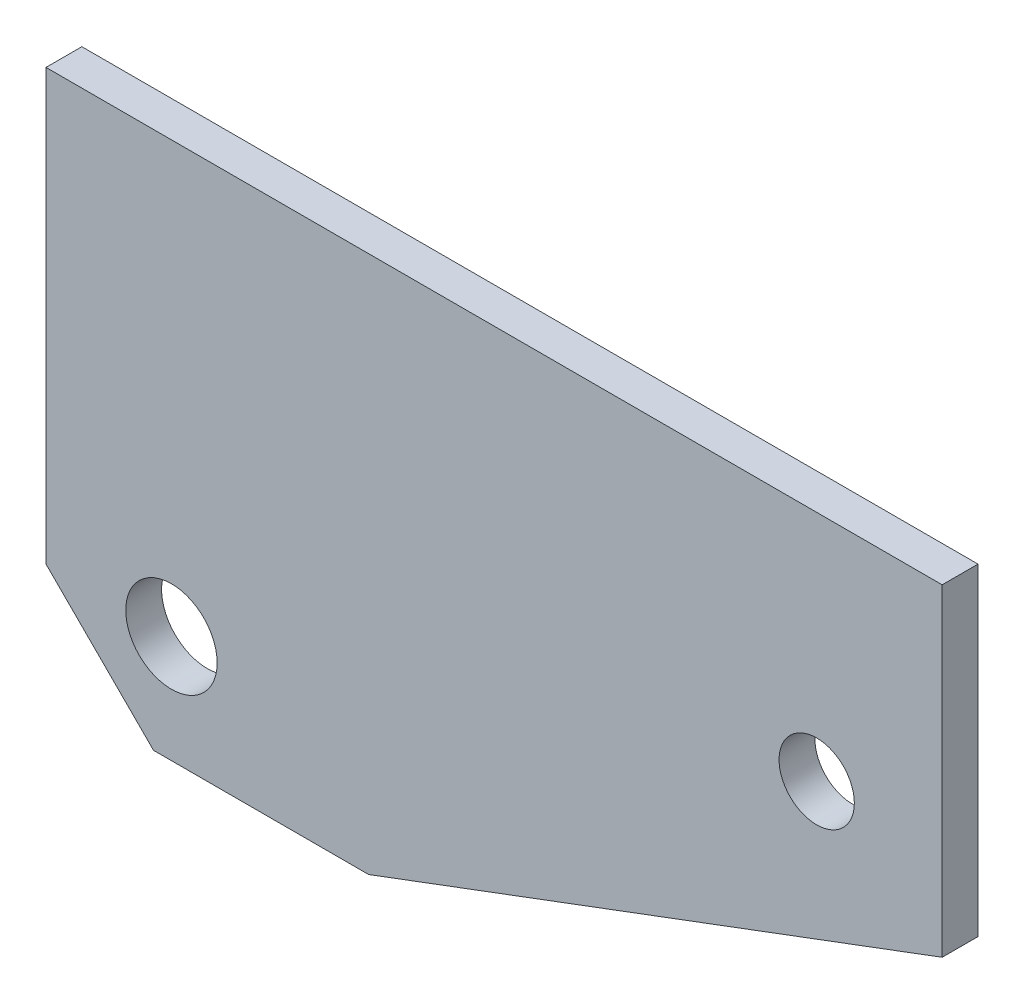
ISO-10303-21;
HEADER;
FILE_DESCRIPTION(('STEP AP214'),'2;1');
FILE_NAME('part.step','',(''),(''),'','','');
FILE_SCHEMA(('AUTOMOTIVE_DESIGN { 1 0 10303 214 1 1 1 1 }'));
ENDSEC;
DATA;
#1=APPLICATION_CONTEXT('core data for automotive mechanical design processes');
#2=APPLICATION_PROTOCOL_DEFINITION('international standard','automotive_design',2000,#1);
#3=PRODUCT_CONTEXT('',#1,'mechanical');
#4=PRODUCT('Part','Part','',(#3));
#5=PRODUCT_RELATED_PRODUCT_CATEGORY('part','',(#4));
#6=PRODUCT_DEFINITION_FORMATION('','',#4);
#7=PRODUCT_DEFINITION_CONTEXT('part definition',#1,'design');
#8=PRODUCT_DEFINITION('design','',#6,#7);
#9=PRODUCT_DEFINITION_SHAPE('','',#8);
#10=(LENGTH_UNIT() NAMED_UNIT(*) SI_UNIT(.MILLI.,.METRE.));
#11=(NAMED_UNIT(*) PLANE_ANGLE_UNIT() SI_UNIT($,.RADIAN.));
#12=(NAMED_UNIT(*) SI_UNIT($,.STERADIAN.) SOLID_ANGLE_UNIT());
#13=UNCERTAINTY_MEASURE_WITH_UNIT(LENGTH_MEASURE(1.E-05),#10,'distance_accuracy_value','');
#14=(GEOMETRIC_REPRESENTATION_CONTEXT(3) GLOBAL_UNCERTAINTY_ASSIGNED_CONTEXT((#13)) GLOBAL_UNIT_ASSIGNED_CONTEXT((#10,
#11,#12)) REPRESENTATION_CONTEXT('',''));
#15=CARTESIAN_POINT('',(0.,0.,0.));
#16=DIRECTION('',(0.,0.,1.));
#17=DIRECTION('',(1.,0.,0.));
#18=AXIS2_PLACEMENT_3D('',#15,#16,#17);
#19=CARTESIAN_POINT('',(0.,-150.,10.));
#20=DIRECTION('',(0.,0.,1.));
#21=DIRECTION('',(1.,0.,0.));
#22=AXIS2_PLACEMENT_3D('',#19,#20,#21);
#23=PLANE('',#22);
#24=CARTESIAN_POINT('',(215.,-65.,10.));
#25=DIRECTION('',(0.,0.,1.));
#26=DIRECTION('',(1.,0.,0.));
#27=AXIS2_PLACEMENT_3D('',#24,#25,#26);
#28=CIRCLE('',#27,10.5);
#29=CARTESIAN_POINT('',(225.5,-65.,10.));
#30=VERTEX_POINT('',#29);
#31=EDGE_CURVE('E101',#30,#30,#28,.T.);
#32=ORIENTED_EDGE('',*,*,#31,.F.);
#33=EDGE_LOOP('',(#32));
#34=FACE_BOUND('',#33,.T.);
#35=DIRECTION('',(0.,-1.,0.));
#36=VECTOR('',#35,1.);
#37=CARTESIAN_POINT('',(0.,0.,10.));
#38=LINE('',#37,#36);
#39=CARTESIAN_POINT('',(0.,0.,10.));
#40=VERTEX_POINT('',#39);
#41=CARTESIAN_POINT('',(0.,-120.,10.));
#42=VERTEX_POINT('',#41);
#43=EDGE_CURVE('E115',#40,#42,#38,.T.);
#44=ORIENTED_EDGE('',*,*,#43,.T.);
#45=DIRECTION('',(0.707106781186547,-0.707106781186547,0.));
#46=VECTOR('',#45,1.);
#47=CARTESIAN_POINT('',(0.,-120.,10.));
#48=LINE('',#47,#46);
#49=CARTESIAN_POINT('',(30.,-150.,10.));
#50=VERTEX_POINT('',#49);
#51=EDGE_CURVE('E96',#42,#50,#48,.T.);
#52=ORIENTED_EDGE('',*,*,#51,.T.);
#53=DIRECTION('',(1.,0.,0.));
#54=VECTOR('',#53,1.);
#55=CARTESIAN_POINT('',(30.,-150.,10.));
#56=LINE('',#55,#54);
#57=CARTESIAN_POINT('',(90.,-150.,10.));
#58=VERTEX_POINT('',#57);
#59=EDGE_CURVE('E118',#50,#58,#56,.T.);
#60=ORIENTED_EDGE('',*,*,#59,.T.);
#61=DIRECTION('',(0.936329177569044,0.351123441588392,0.));
#62=VECTOR('',#61,1.);
#63=CARTESIAN_POINT('',(90.,-150.,10.));
#64=LINE('',#63,#62);
#65=CARTESIAN_POINT('',(250.,-90.,10.));
#66=VERTEX_POINT('',#65);
#67=EDGE_CURVE('E120',#58,#66,#64,.T.);
#68=ORIENTED_EDGE('',*,*,#67,.T.);
#69=DIRECTION('',(0.,1.,0.));
#70=VECTOR('',#69,1.);
#71=CARTESIAN_POINT('',(250.,0.,10.));
#72=LINE('',#71,#70);
#73=CARTESIAN_POINT('',(250.,0.,10.));
#74=VERTEX_POINT('',#73);
#75=EDGE_CURVE('E49',#66,#74,#72,.T.);
#76=ORIENTED_EDGE('',*,*,#75,.T.);
#77=DIRECTION('',(-1.,0.,0.));
#78=VECTOR('',#77,1.);
#79=CARTESIAN_POINT('',(0.,0.,10.));
#80=LINE('',#79,#78);
#81=EDGE_CURVE('E44',#74,#40,#80,.T.);
#82=ORIENTED_EDGE('',*,*,#81,.T.);
#83=EDGE_LOOP('',(#44,#52,#60,#68,#76,#82));
#84=FACE_BOUND('',#83,.T.);
#85=CARTESIAN_POINT('',(35.,-120.,10.));
#86=DIRECTION('',(0.,0.,1.));
#87=DIRECTION('',(1.,0.,0.));
#88=AXIS2_PLACEMENT_3D('',#85,#86,#87);
#89=CIRCLE('',#88,12.75);
#90=CARTESIAN_POINT('',(47.75,-120.,10.));
#91=VERTEX_POINT('',#90);
#92=EDGE_CURVE('E175',#91,#91,#89,.T.);
#93=ORIENTED_EDGE('',*,*,#92,.F.);
#94=EDGE_LOOP('',(#93));
#95=FACE_BOUND('',#94,.T.);
#96=ADVANCED_FACE('F29',(#34,#84,#95),#23,.T.);
#97=CARTESIAN_POINT('',(0.,-150.,0.));
#98=DIRECTION('',(0.,0.,1.));
#99=DIRECTION('',(1.,0.,0.));
#100=AXIS2_PLACEMENT_3D('',#97,#98,#99);
#101=PLANE('',#100);
#102=CARTESIAN_POINT('',(215.,-65.,0.));
#103=DIRECTION('',(0.,0.,1.));
#104=DIRECTION('',(1.,0.,0.));
#105=AXIS2_PLACEMENT_3D('',#102,#103,#104);
#106=CIRCLE('',#105,10.5);
#107=CARTESIAN_POINT('',(225.5,-65.,0.));
#108=VERTEX_POINT('',#107);
#109=EDGE_CURVE('E104',#108,#108,#106,.T.);
#110=ORIENTED_EDGE('',*,*,#109,.T.);
#111=EDGE_LOOP('',(#110));
#112=FACE_BOUND('',#111,.T.);
#113=DIRECTION('',(0.,-1.,0.));
#114=VECTOR('',#113,1.);
#115=CARTESIAN_POINT('',(0.,0.,0.));
#116=LINE('',#115,#114);
#117=CARTESIAN_POINT('',(0.,0.,0.));
#118=VERTEX_POINT('',#117);
#119=CARTESIAN_POINT('',(0.,-120.,0.));
#120=VERTEX_POINT('',#119);
#121=EDGE_CURVE('E87',#118,#120,#116,.T.);
#122=ORIENTED_EDGE('',*,*,#121,.F.);
#123=DIRECTION('',(-1.,0.,0.));
#124=VECTOR('',#123,1.);
#125=CARTESIAN_POINT('',(0.,0.,0.));
#126=LINE('',#125,#124);
#127=CARTESIAN_POINT('',(250.,0.,0.));
#128=VERTEX_POINT('',#127);
#129=EDGE_CURVE('E113',#128,#118,#126,.T.);
#130=ORIENTED_EDGE('',*,*,#129,.F.);
#131=DIRECTION('',(0.,1.,0.));
#132=VECTOR('',#131,1.);
#133=CARTESIAN_POINT('',(250.,0.,0.));
#134=LINE('',#133,#132);
#135=CARTESIAN_POINT('',(250.,-90.,0.));
#136=VERTEX_POINT('',#135);
#137=EDGE_CURVE('E111',#136,#128,#134,.T.);
#138=ORIENTED_EDGE('',*,*,#137,.F.);
#139=DIRECTION('',(0.936329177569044,0.351123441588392,0.));
#140=VECTOR('',#139,1.);
#141=CARTESIAN_POINT('',(90.,-150.,0.));
#142=LINE('',#141,#140);
#143=CARTESIAN_POINT('',(90.,-150.,0.));
#144=VERTEX_POINT('',#143);
#145=EDGE_CURVE('E109',#144,#136,#142,.T.);
#146=ORIENTED_EDGE('',*,*,#145,.F.);
#147=DIRECTION('',(1.,0.,0.));
#148=VECTOR('',#147,1.);
#149=CARTESIAN_POINT('',(30.,-150.,0.));
#150=LINE('',#149,#148);
#151=CARTESIAN_POINT('',(30.,-150.,0.));
#152=VERTEX_POINT('',#151);
#153=EDGE_CURVE('E89',#152,#144,#150,.T.);
#154=ORIENTED_EDGE('',*,*,#153,.F.);
#155=DIRECTION('',(0.707106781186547,-0.707106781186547,0.));
#156=VECTOR('',#155,1.);
#157=CARTESIAN_POINT('',(0.,-120.,0.));
#158=LINE('',#157,#156);
#159=EDGE_CURVE('E82',#120,#152,#158,.T.);
#160=ORIENTED_EDGE('',*,*,#159,.F.);
#161=EDGE_LOOP('',(#122,#130,#138,#146,#154,#160));
#162=FACE_BOUND('',#161,.T.);
#163=CARTESIAN_POINT('',(35.,-120.,0.));
#164=DIRECTION('',(0.,0.,1.));
#165=DIRECTION('',(1.,0.,0.));
#166=AXIS2_PLACEMENT_3D('',#163,#164,#165);
#167=CIRCLE('',#166,12.75);
#168=CARTESIAN_POINT('',(47.75,-120.,0.));
#169=VERTEX_POINT('',#168);
#170=EDGE_CURVE('E178',#169,#169,#167,.T.);
#171=ORIENTED_EDGE('',*,*,#170,.T.);
#172=EDGE_LOOP('',(#171));
#173=FACE_BOUND('',#172,.T.);
#174=ADVANCED_FACE('F83',(#112,#162,#173),#101,.F.);
#175=CARTESIAN_POINT('',(0.,0.,10.));
#176=DIRECTION('',(1.,0.,0.));
#177=DIRECTION('',(0.,1.,0.));
#178=AXIS2_PLACEMENT_3D('',#175,#176,#177);
#179=PLANE('',#178);
#180=ORIENTED_EDGE('',*,*,#121,.T.);
#181=DIRECTION('',(0.,0.,-1.));
#182=VECTOR('',#181,1.);
#183=CARTESIAN_POINT('',(0.,-120.,10.));
#184=LINE('',#183,#182);
#185=EDGE_CURVE('E11',#42,#120,#184,.T.);
#186=ORIENTED_EDGE('',*,*,#185,.F.);
#187=ORIENTED_EDGE('',*,*,#43,.F.);
#188=DIRECTION('',(0.,0.,-1.));
#189=VECTOR('',#188,1.);
#190=CARTESIAN_POINT('',(0.,0.,10.));
#191=LINE('',#190,#189);
#192=EDGE_CURVE('E100',#40,#118,#191,.T.);
#193=ORIENTED_EDGE('',*,*,#192,.T.);
#194=EDGE_LOOP('',(#180,#186,#187,#193));
#195=FACE_BOUND('',#194,.T.);
#196=ADVANCED_FACE('F31',(#195),#179,.F.);
#197=CARTESIAN_POINT('',(0.,-120.,10.));
#198=DIRECTION('',(0.707106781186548,0.707106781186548,0.));
#199=DIRECTION('',(-0.707106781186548,0.707106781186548,0.));
#200=AXIS2_PLACEMENT_3D('',#197,#198,#199);
#201=PLANE('',#200);
#202=ORIENTED_EDGE('',*,*,#159,.T.);
#203=DIRECTION('',(0.,0.,-1.));
#204=VECTOR('',#203,1.);
#205=CARTESIAN_POINT('',(30.,-150.,10.));
#206=LINE('',#205,#204);
#207=EDGE_CURVE('E37',#50,#152,#206,.T.);
#208=ORIENTED_EDGE('',*,*,#207,.F.);
#209=ORIENTED_EDGE('',*,*,#51,.F.);
#210=ORIENTED_EDGE('',*,*,#185,.T.);
#211=EDGE_LOOP('',(#202,#208,#209,#210));
#212=FACE_BOUND('',#211,.T.);
#213=ADVANCED_FACE('F95',(#212),#201,.F.);
#214=CARTESIAN_POINT('',(30.,-150.,10.));
#215=DIRECTION('',(0.,1.,0.));
#216=DIRECTION('',(0.,0.,1.));
#217=AXIS2_PLACEMENT_3D('',#214,#215,#216);
#218=PLANE('',#217);
#219=ORIENTED_EDGE('',*,*,#153,.T.);
#220=DIRECTION('',(0.,0.,-1.));
#221=VECTOR('',#220,1.);
#222=CARTESIAN_POINT('',(90.,-150.,10.));
#223=LINE('',#222,#221);
#224=EDGE_CURVE('E131',#58,#144,#223,.T.);
#225=ORIENTED_EDGE('',*,*,#224,.F.);
#226=ORIENTED_EDGE('',*,*,#59,.F.);
#227=ORIENTED_EDGE('',*,*,#207,.T.);
#228=EDGE_LOOP('',(#219,#225,#226,#227));
#229=FACE_BOUND('',#228,.T.);
#230=ADVANCED_FACE('F135',(#229),#218,.F.);
#231=CARTESIAN_POINT('',(90.,-150.,10.));
#232=DIRECTION('',(-0.351123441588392,0.936329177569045,0.));
#233=DIRECTION('',(-0.936329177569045,-0.351123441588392,0.));
#234=AXIS2_PLACEMENT_3D('',#231,#232,#233);
#235=PLANE('',#234);
#236=ORIENTED_EDGE('',*,*,#145,.T.);
#237=DIRECTION('',(0.,0.,-1.));
#238=VECTOR('',#237,1.);
#239=CARTESIAN_POINT('',(250.,-90.,10.));
#240=LINE('',#239,#238);
#241=EDGE_CURVE('E128',#66,#136,#240,.T.);
#242=ORIENTED_EDGE('',*,*,#241,.F.);
#243=ORIENTED_EDGE('',*,*,#67,.F.);
#244=ORIENTED_EDGE('',*,*,#224,.T.);
#245=EDGE_LOOP('',(#236,#242,#243,#244));
#246=FACE_BOUND('',#245,.T.);
#247=ADVANCED_FACE('F141',(#246),#235,.F.);
#248=CARTESIAN_POINT('',(250.,0.,10.));
#249=DIRECTION('',(-1.,0.,0.));
#250=DIRECTION('',(0.,0.,1.));
#251=AXIS2_PLACEMENT_3D('',#248,#249,#250);
#252=PLANE('',#251);
#253=ORIENTED_EDGE('',*,*,#137,.T.);
#254=DIRECTION('',(0.,0.,-1.));
#255=VECTOR('',#254,1.);
#256=CARTESIAN_POINT('',(250.,0.,10.));
#257=LINE('',#256,#255);
#258=EDGE_CURVE('E125',#74,#128,#257,.T.);
#259=ORIENTED_EDGE('',*,*,#258,.F.);
#260=ORIENTED_EDGE('',*,*,#75,.F.);
#261=ORIENTED_EDGE('',*,*,#241,.T.);
#262=EDGE_LOOP('',(#253,#259,#260,#261));
#263=FACE_BOUND('',#262,.T.);
#264=ADVANCED_FACE('F144',(#263),#252,.F.);
#265=CARTESIAN_POINT('',(0.,0.,10.));
#266=DIRECTION('',(0.,-1.,0.));
#267=DIRECTION('',(0.,0.,-1.));
#268=AXIS2_PLACEMENT_3D('',#265,#266,#267);
#269=PLANE('',#268);
#270=ORIENTED_EDGE('',*,*,#129,.T.);
#271=ORIENTED_EDGE('',*,*,#192,.F.);
#272=ORIENTED_EDGE('',*,*,#81,.F.);
#273=ORIENTED_EDGE('',*,*,#258,.T.);
#274=EDGE_LOOP('',(#270,#271,#272,#273));
#275=FACE_BOUND('',#274,.T.);
#276=ADVANCED_FACE('F146',(#275),#269,.F.);
#277=CARTESIAN_POINT('',(215.,-65.,10.));
#278=DIRECTION('',(0.,0.,-1.));
#279=DIRECTION('',(-1.,0.,0.));
#280=AXIS2_PLACEMENT_3D('',#277,#278,#279);
#281=CYLINDRICAL_SURFACE('',#280,10.5);
#282=ORIENTED_EDGE('',*,*,#31,.T.);
#283=EDGE_LOOP('',(#282));
#284=FACE_BOUND('',#283,.T.);
#285=ORIENTED_EDGE('',*,*,#109,.F.);
#286=EDGE_LOOP('',(#285));
#287=FACE_BOUND('',#286,.T.);
#288=ADVANCED_FACE('F148',(#284,#287),#281,.F.);
#289=CARTESIAN_POINT('',(35.,-120.,10.));
#290=DIRECTION('',(0.,0.,-1.));
#291=DIRECTION('',(-1.,0.,0.));
#292=AXIS2_PLACEMENT_3D('',#289,#290,#291);
#293=CYLINDRICAL_SURFACE('',#292,12.75);
#294=ORIENTED_EDGE('',*,*,#92,.T.);
#295=EDGE_LOOP('',(#294));
#296=FACE_BOUND('',#295,.T.);
#297=ORIENTED_EDGE('',*,*,#170,.F.);
#298=EDGE_LOOP('',(#297));
#299=FACE_BOUND('',#298,.T.);
#300=ADVANCED_FACE('F154',(#296,#299),#293,.F.);
#301=CLOSED_SHELL('',(#96,#174,#196,#213,#230,#247,#264,#276,#288,#300));
#302=MANIFOLD_SOLID_BREP('B2',#301);
#303=ADVANCED_BREP_SHAPE_REPRESENTATION('',(#18,#302),#14);
#304=SHAPE_DEFINITION_REPRESENTATION(#9,#303);
ENDSEC;
END-ISO-10303-21;
